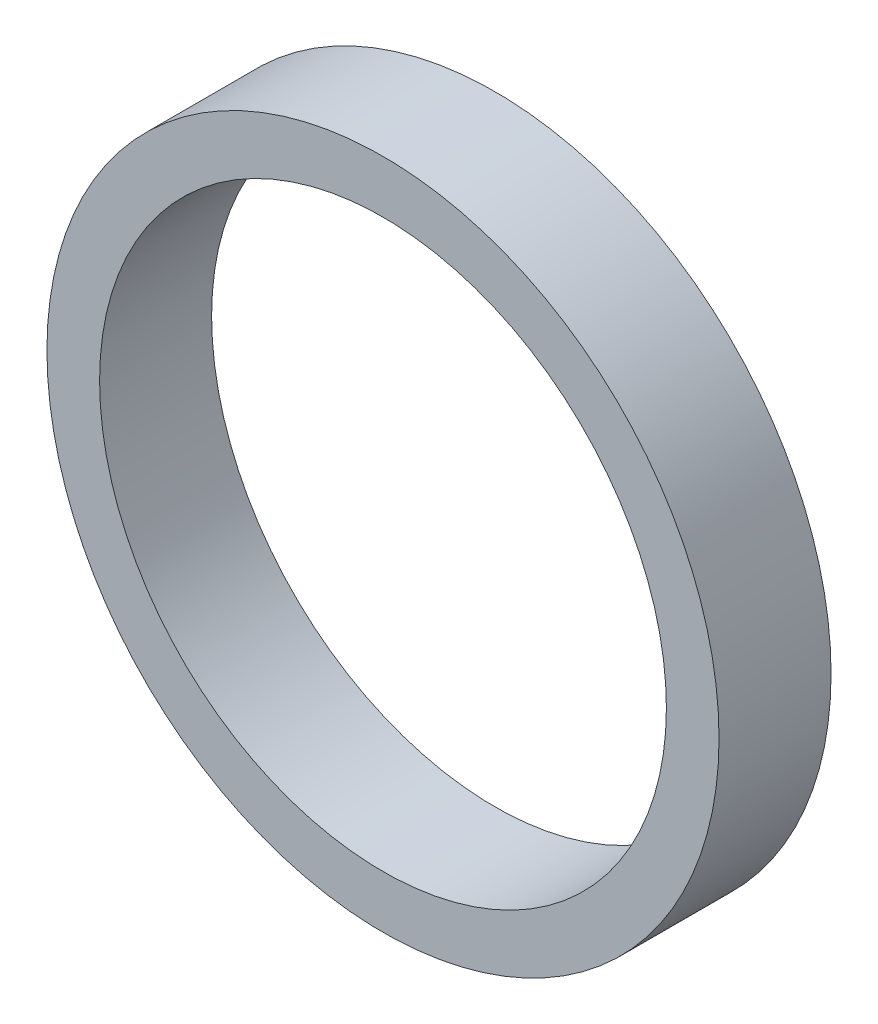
ISO-10303-21;
HEADER;
FILE_DESCRIPTION(('STEP AP214'),'2;1');
FILE_NAME('part.step','',(''),(''),'','','');
FILE_SCHEMA(('AUTOMOTIVE_DESIGN { 1 0 10303 214 1 1 1 1 }'));
ENDSEC;
DATA;
#1=APPLICATION_CONTEXT('core data for automotive mechanical design processes');
#2=APPLICATION_PROTOCOL_DEFINITION('international standard','automotive_design',2000,#1);
#3=PRODUCT_CONTEXT('',#1,'mechanical');
#4=PRODUCT('Part','Part','',(#3));
#5=PRODUCT_RELATED_PRODUCT_CATEGORY('part','',(#4));
#6=PRODUCT_DEFINITION_FORMATION('','',#4);
#7=PRODUCT_DEFINITION_CONTEXT('part definition',#1,'design');
#8=PRODUCT_DEFINITION('design','',#6,#7);
#9=PRODUCT_DEFINITION_SHAPE('','',#8);
#10=(LENGTH_UNIT() NAMED_UNIT(*) SI_UNIT(.MILLI.,.METRE.));
#11=(NAMED_UNIT(*) PLANE_ANGLE_UNIT() SI_UNIT($,.RADIAN.));
#12=(NAMED_UNIT(*) SI_UNIT($,.STERADIAN.) SOLID_ANGLE_UNIT());
#13=UNCERTAINTY_MEASURE_WITH_UNIT(LENGTH_MEASURE(1.E-05),#10,'distance_accuracy_value','');
#14=(GEOMETRIC_REPRESENTATION_CONTEXT(3) GLOBAL_UNCERTAINTY_ASSIGNED_CONTEXT((#13)) GLOBAL_UNIT_ASSIGNED_CONTEXT((#10,
#11,#12)) REPRESENTATION_CONTEXT('',''));
#15=CARTESIAN_POINT('',(0.,0.,0.));
#16=DIRECTION('',(0.,0.,1.));
#17=DIRECTION('',(1.,0.,0.));
#18=AXIS2_PLACEMENT_3D('',#15,#16,#17);
#19=CARTESIAN_POINT('',(0.,0.,6.35));
#20=DIRECTION('',(0.,0.,1.));
#21=DIRECTION('',(1.,0.,0.));
#22=AXIS2_PLACEMENT_3D('',#19,#20,#21);
#23=PLANE('',#22);
#24=CARTESIAN_POINT('',(0.,0.,6.35));
#25=DIRECTION('',(0.,0.,1.));
#26=DIRECTION('',(1.,0.,0.));
#27=AXIS2_PLACEMENT_3D('',#24,#25,#26);
#28=CIRCLE('',#27,19.05);
#29=CARTESIAN_POINT('',(19.05,0.,6.35));
#30=VERTEX_POINT('',#29);
#31=EDGE_CURVE('E10',#30,#30,#28,.T.);
#32=ORIENTED_EDGE('',*,*,#31,.T.);
#33=EDGE_LOOP('',(#32));
#34=FACE_BOUND('',#33,.T.);
#35=CARTESIAN_POINT('',(0.,0.,6.35));
#36=DIRECTION('',(0.,0.,1.));
#37=DIRECTION('',(1.,0.,0.));
#38=AXIS2_PLACEMENT_3D('',#35,#36,#37);
#39=CIRCLE('',#38,16.0655);
#40=CARTESIAN_POINT('',(16.0655,0.,6.35));
#41=VERTEX_POINT('',#40);
#42=EDGE_CURVE('E39',#41,#41,#39,.T.);
#43=ORIENTED_EDGE('',*,*,#42,.F.);
#44=EDGE_LOOP('',(#43));
#45=FACE_BOUND('',#44,.T.);
#46=ADVANCED_FACE('F28',(#34,#45),#23,.T.);
#47=CARTESIAN_POINT('',(0.,0.,0.));
#48=DIRECTION('',(0.,0.,1.));
#49=DIRECTION('',(1.,0.,0.));
#50=AXIS2_PLACEMENT_3D('',#47,#48,#49);
#51=PLANE('',#50);
#52=CARTESIAN_POINT('',(0.,0.,0.));
#53=DIRECTION('',(0.,0.,1.));
#54=DIRECTION('',(1.,0.,0.));
#55=AXIS2_PLACEMENT_3D('',#52,#53,#54);
#56=CIRCLE('',#55,19.05);
#57=CARTESIAN_POINT('',(19.05,0.,0.));
#58=VERTEX_POINT('',#57);
#59=EDGE_CURVE('E35',#58,#58,#56,.T.);
#60=ORIENTED_EDGE('',*,*,#59,.F.);
#61=EDGE_LOOP('',(#60));
#62=FACE_BOUND('',#61,.T.);
#63=CARTESIAN_POINT('',(0.,0.,0.));
#64=DIRECTION('',(0.,0.,1.));
#65=DIRECTION('',(1.,0.,0.));
#66=AXIS2_PLACEMENT_3D('',#63,#64,#65);
#67=CIRCLE('',#66,16.0655);
#68=CARTESIAN_POINT('',(16.0655,0.,0.));
#69=VERTEX_POINT('',#68);
#70=EDGE_CURVE('E43',#69,#69,#67,.T.);
#71=ORIENTED_EDGE('',*,*,#70,.T.);
#72=EDGE_LOOP('',(#71));
#73=FACE_BOUND('',#72,.T.);
#74=ADVANCED_FACE('F49',(#62,#73),#51,.F.);
#75=CARTESIAN_POINT('',(0.,0.,6.35));
#76=DIRECTION('',(0.,0.,-1.));
#77=DIRECTION('',(-1.,0.,0.));
#78=AXIS2_PLACEMENT_3D('',#75,#76,#77);
#79=CYLINDRICAL_SURFACE('',#78,19.05);
#80=ORIENTED_EDGE('',*,*,#31,.F.);
#81=EDGE_LOOP('',(#80));
#82=FACE_BOUND('',#81,.T.);
#83=ORIENTED_EDGE('',*,*,#59,.T.);
#84=EDGE_LOOP('',(#83));
#85=FACE_BOUND('',#84,.T.);
#86=ADVANCED_FACE('F30',(#82,#85),#79,.T.);
#87=CARTESIAN_POINT('',(0.,0.,6.35));
#88=DIRECTION('',(0.,0.,-1.));
#89=DIRECTION('',(-1.,0.,0.));
#90=AXIS2_PLACEMENT_3D('',#87,#88,#89);
#91=CYLINDRICAL_SURFACE('',#90,16.0655);
#92=ORIENTED_EDGE('',*,*,#42,.T.);
#93=EDGE_LOOP('',(#92));
#94=FACE_BOUND('',#93,.T.);
#95=ORIENTED_EDGE('',*,*,#70,.F.);
#96=EDGE_LOOP('',(#95));
#97=FACE_BOUND('',#96,.T.);
#98=ADVANCED_FACE('F51',(#94,#97),#91,.F.);
#99=CLOSED_SHELL('',(#46,#74,#86,#98));
#100=MANIFOLD_SOLID_BREP('B2',#99);
#101=ADVANCED_BREP_SHAPE_REPRESENTATION('',(#18,#100),#14);
#102=SHAPE_DEFINITION_REPRESENTATION(#9,#101);
ENDSEC;
END-ISO-10303-21;
